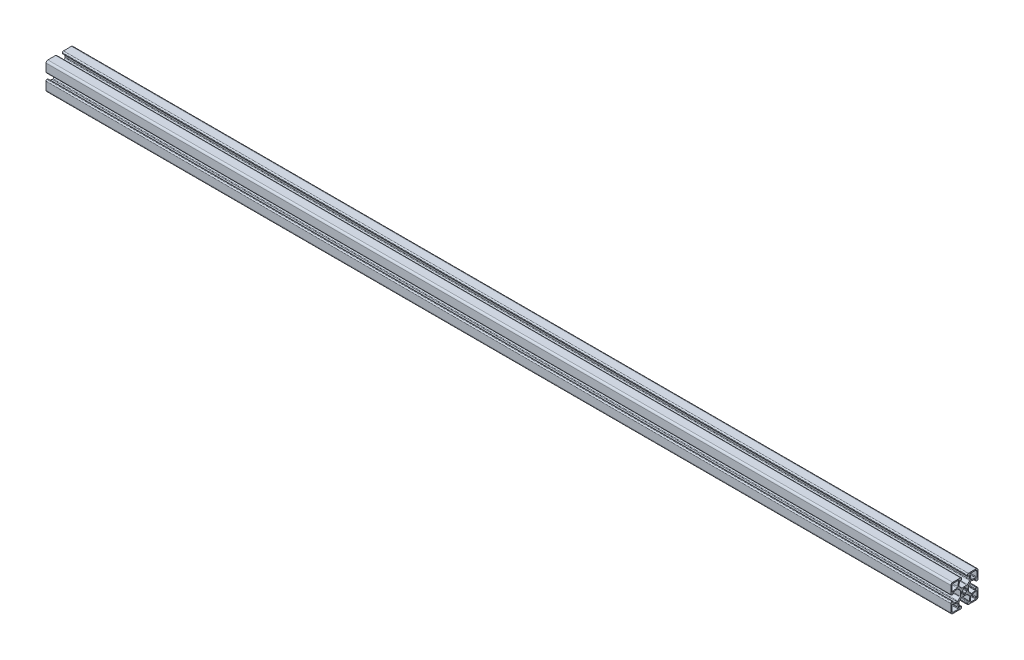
from build123d import *

# Parameters (mm, degrees)
EXTRUDE_1_DEPTH = 1000


with BuildPart() as part:
    # Sketch 1 → Extrude 1 (new body)
    with BuildSketch(Plane(origin=(0, 0, 0), x_dir=(0, 0, -1), z_dir=(1, 0, 0))):
        with BuildLine():
            Line((13.799999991, -3.150000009), (13.150000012, -3.150000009))
            ThreePointArc((13.150000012, -3.150000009), (12.619669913, -3.369669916), (12.399999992, -3.900000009))
            Line((12.399999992, -3.900000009), (12.399999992, -4.892473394))
            ThreePointArc((12.399999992, -4.892473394), (12.283022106, -5.213867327), (11.986823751, -5.384877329))
            Line((11.986823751, -5.384877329), (8.089371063, -6.072103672))
            ThreePointArc((8.089371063, -6.072103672), (7.61501703, -6.041012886), (7.208616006, -5.794402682))
            Line((7.208616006, -5.794402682), (4.792892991, -3.378679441))
            ThreePointArc((4.792892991, -3.378679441), (4.576120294, -3.054256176), (4.499999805, -2.67157285))
            Line((4.499999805, -2.67157285), (4.499999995, 2.671572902))
            ThreePointArc((4.499999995, 2.671572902), (4.576120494, 3.054256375), (4.792893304, 3.378679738))
            Line((4.792893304, 3.378679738), (7.208616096, 5.79440253))
            ThreePointArc((7.208616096, 5.79440253), (7.615017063, 6.041012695), (8.089371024, 6.072103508))
            Line((8.089371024, 6.072103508), (11.986824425, 5.384877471))
            ThreePointArc((11.986824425, 5.384877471), (12.283022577, 5.213867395), (12.400000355, 4.892473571))
            Line((12.400000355, 4.892473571), (12.400000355, 3.899999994))
            ThreePointArc((12.400000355, 3.899999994), (12.619670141, 3.369670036), (13.149999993, 3.149999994))
            Line((13.149999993, 3.149999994), (13.799999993, 3.149999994))
            ThreePointArc((13.799999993, 3.149999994), (14.648528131, 3.501471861), (14.999999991, 4.350000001))
            Line((14.999999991, 4.350000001), (14.999999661, 13.000000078))
            ThreePointArc((14.999999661, 13.000000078), (14.414213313, 14.414213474), (12.999999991, 15.000000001))
            Line((12.999999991, 15.000000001), (4.349999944, 14.999999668))
            ThreePointArc((4.349999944, 14.999999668), (3.501471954, 14.648527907), (3.14999999, 13.800000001))
            Line((3.14999999, 13.800000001), (3.14999999, 13.150000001))
            ThreePointArc((3.14999999, 13.150000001), (3.369669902, 12.619669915), (3.899999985, 12.399999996))
            Line((3.899999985, 12.399999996), (4.89247338, 12.399999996))
            ThreePointArc((4.89247338, 12.399999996), (5.213867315, 12.283022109), (5.384877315, 11.986823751))
            Line((5.384877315, 11.986823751), (6.072103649, 8.08937105))
            ThreePointArc((6.072103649, 8.08937105), (6.041012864, 7.615017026), (5.794402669, 7.208616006))
            Line((5.794402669, 7.208616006), (3.37867942, 4.792892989))
            ThreePointArc((3.37867942, 4.792892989), (3.054256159, 4.576120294), (2.671572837, 4.499999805))
            Line((2.671572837, 4.499999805), (-2.671572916, 4.499999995))
            ThreePointArc((-2.671572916, 4.499999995), (-3.054256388, 4.576120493), (-3.378679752, 4.792893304))
            Line((-3.378679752, 4.792893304), (-5.79440254, 7.208616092))
            ThreePointArc((-5.79440254, 7.208616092), (-6.041012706, 7.615017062), (-6.072103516, 8.089371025))
            Line((-6.072103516, 8.089371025), (-5.384877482, 11.986824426))
            ThreePointArc((-5.384877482, 11.986824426), (-5.213867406, 12.283022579), (-4.892473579, 12.400000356))
            Line((-4.892473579, 12.400000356), (-3.900000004, 12.400000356))
            ThreePointArc((-3.900000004, 12.400000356), (-3.369670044, 12.619670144), (-3.150000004, 13.15))
            Line((-3.150000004, 13.15), (-3.150000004, 13.8))
            ThreePointArc((-3.150000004, 13.8), (-3.501471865, 14.648528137), (-4.350000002, 15.000000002))
            Line((-4.350000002, 15.000000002), (-13.000000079, 14.999999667))
            ThreePointArc((-13.000000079, 14.999999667), (-14.414213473, 14.41421332), (-15.000000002, 13.000000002))
            Line((-15.000000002, 13.000000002), (-14.999999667, 4.349999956))
            ThreePointArc((-14.999999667, 4.349999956), (-14.648527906, 3.501471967), (-13.800000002, 3.150000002))
            Line((-13.800000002, 3.150000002), (-13.150000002, 3.150000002))
            ThreePointArc((-13.150000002, 3.150000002), (-12.619669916, 3.369669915), (-12.4, 3.9))
            Line((-12.4, 3.9), (-12.4, 4.892473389))
            ThreePointArc((-12.4, 4.892473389), (-12.283022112, 5.213867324), (-11.986823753, 5.384877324))
            Line((-11.986823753, 5.384877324), (-8.089371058, 6.072103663))
            ThreePointArc((-8.089371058, 6.072103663), (-7.615017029, 6.041012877), (-7.208616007, 5.794402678))
            Line((-7.208616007, 5.794402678), (-4.79289299, 3.378679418))
            ThreePointArc((-4.79289299, 3.378679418), (-4.576120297, 3.054256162), (-4.499999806, 2.671572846))
            Line((-4.499999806, 2.671572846), (-4.500000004, -2.671572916))
            ThreePointArc((-4.500000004, -2.671572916), (-4.576120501, -3.054256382), (-4.792893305, -3.378679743))
            Line((-4.792893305, -3.378679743), (-7.208616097, -5.794402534))
            ThreePointArc((-7.208616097, -5.794402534), (-7.615017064, -6.041012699), (-8.089371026, -6.072103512))
            Line((-8.089371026, -6.072103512), (-11.986824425, -5.384877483))
            ThreePointArc((-11.986824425, -5.384877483), (-12.28302258, -5.213867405), (-12.400000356, -4.892473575))
            Line((-12.400000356, -4.892473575), (-12.400000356, -3.900000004))
            ThreePointArc((-12.400000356, -3.900000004), (-12.619679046, -3.369661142), (-13.150025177, -3.150000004))
            Line((-13.150025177, -3.150000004), (-13.800000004, -3.150000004))
            ThreePointArc((-13.800000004, -3.150000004), (-14.648528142, -3.501471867), (-15.000000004, -4.350000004))
            Line((-15.000000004, -4.350000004), (-14.999999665, -13.000000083))
            ThreePointArc((-14.999999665, -13.000000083), (-14.414213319, -14.414213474), (-13.000000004, -15.000000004))
            Line((-13.000000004, -15.000000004), (-4.349999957, -14.999999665))
            ThreePointArc((-4.349999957, -14.999999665), (-3.50147197, -14.648527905), (-3.150000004, -13.800000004))
            Line((-3.150000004, -13.800000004), (-3.150000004, -13.150000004))
            ThreePointArc((-3.150000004, -13.150000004), (-3.369669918, -12.619669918), (-3.900000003, -12.400000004))
            Line((-3.900000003, -12.400000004), (-4.892473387, -12.400000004))
            ThreePointArc((-4.892473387, -12.400000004), (-5.213867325, -12.283022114), (-5.384877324, -11.986823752))
            Line((-5.384877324, -11.986823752), (-6.072103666, -8.089371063))
            ThreePointArc((-6.072103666, -8.089371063), (-6.04101288, -7.615017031), (-5.794402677, -7.208616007))
            Line((-5.794402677, -7.208616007), (-3.378679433, -4.792892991))
            ThreePointArc((-3.378679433, -4.792892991), (-3.05425617, -4.576120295), (-2.671572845, -4.499999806))
            Line((-2.671572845, -4.499999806), (2.671572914, -4.500000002))
            ThreePointArc((2.671572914, -4.500000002), (3.054256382, -4.576120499), (3.378679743, -4.792893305))
            Line((3.378679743, -4.792893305), (5.794402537, -7.208616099))
            ThreePointArc((5.794402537, -7.208616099), (6.041012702, -7.615017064), (6.072103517, -8.089371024))
            Line((6.072103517, -8.089371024), (5.384877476, -11.986824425))
            ThreePointArc((5.384877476, -11.986824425), (5.213867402, -12.283022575), (4.89247358, -12.400000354))
            Line((4.89247358, -12.400000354), (3.899999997, -12.400000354))
            ThreePointArc((3.899999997, -12.400000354), (3.369670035, -12.619670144), (3.149999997, -13.150000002))
            Line((3.149999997, -13.150000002), (3.149999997, -13.800000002))
            ThreePointArc((3.149999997, -13.800000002), (3.501471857, -14.64852814), (4.34999999, -15.000000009))
            Line((4.34999999, -15.000000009), (13.000000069, -14.999999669))
            ThreePointArc((13.000000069, -14.999999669), (14.414213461, -14.414213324), (14.999999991, -13.000000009))
            Line((14.999999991, -13.000000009), (14.999999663, -4.349999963))
            ThreePointArc((14.999999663, -4.349999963), (14.648527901, -3.501471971), (13.799999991, -3.150000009))
        make_face()
        with BuildLine():
            Line((-12.451471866, -13.820000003), (-6.649665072, -13.820000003))
            ThreePointArc((-6.649665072, -13.820000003), (-6.185885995, -13.535178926), (-6.230161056, -12.992727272))
            ThreePointArc((-6.230161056, -12.992727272), (-6.420017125, -12.6594169), (-6.529318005, -12.291728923))
            Line((-6.529318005, -12.291728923), (-7.269060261, -8.096442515))
            ThreePointArc((-7.269060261, -8.096442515), (-7.552315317, -7.552314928), (-8.096442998, -7.269060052))
            Line((-8.096442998, -7.269060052), (-12.29172854, -6.529318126))
            ThreePointArc((-12.29172854, -6.529318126), (-12.659416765, -6.420017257), (-12.992727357, -6.230161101))
            ThreePointArc((-12.992727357, -6.230161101), (-13.535178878, -6.185886), (-13.82, -6.649664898))
            Line((-13.82, -6.649664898), (-13.82, -12.451471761))
            ThreePointArc((-13.82, -12.451471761), (-13.655996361, -12.830505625), (-13.267436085, -12.970451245))
            ThreePointArc((-13.267436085, -12.970451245), (-13.051911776, -13.051911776), (-12.970451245, -13.267436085))
            ThreePointArc((-12.970451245, -13.267436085), (-12.830505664, -13.655996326), (-12.451471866, -13.820000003))
        make_face(mode=Mode.SUBTRACT)
        with BuildLine():
            Line((12.451471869, 13.820000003), (6.649665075, 13.820000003))
            ThreePointArc((6.649665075, 13.820000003), (6.185885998, 13.535178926), (6.230161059, 12.992727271))
            ThreePointArc((6.230161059, 12.992727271), (6.42001711, 12.659416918), (6.529317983, 12.291728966))
            Line((6.529317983, 12.291728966), (7.269060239, 8.096442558))
            ThreePointArc((7.269060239, 8.096442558), (7.552315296, 7.552314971), (8.096442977, 7.269060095))
            Line((8.096442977, 7.269060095), (12.291728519, 6.529318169))
            ThreePointArc((12.291728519, 6.529318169), (12.659416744, 6.4200173), (12.992727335, 6.230161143))
            ThreePointArc((12.992727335, 6.230161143), (13.535178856, 6.185886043), (13.819999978, 6.64966494))
            Line((13.819999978, 6.64966494), (13.819999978, 12.451471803))
            ThreePointArc((13.819999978, 12.451471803), (13.655996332, 12.83050563), (13.267436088, 12.970451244))
            ThreePointArc((13.267436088, 12.970451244), (13.051911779, 13.051911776), (12.970451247, 13.267436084))
            ThreePointArc((12.970451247, 13.267436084), (12.830505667, 13.655996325), (12.451471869, 13.820000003))
        make_face(mode=Mode.SUBTRACT)
        with BuildLine():
            Line((-13.82, 12.451471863), (-13.82, 6.649665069))
            ThreePointArc((-13.82, 6.649665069), (-13.535178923, 6.185885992), (-12.992727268, 6.230161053))
            ThreePointArc((-12.992727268, 6.230161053), (-12.659416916, 6.420017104), (-12.291728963, 6.529317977))
            Line((-12.291728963, 6.529317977), (-8.096442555, 7.269060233))
            ThreePointArc((-8.096442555, 7.269060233), (-7.552314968, 7.552315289), (-7.269060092, 8.09644297))
            Line((-7.269060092, 8.09644297), (-6.529318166, 12.291728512))
            ThreePointArc((-6.529318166, 12.291728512), (-6.420017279, 12.659416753), (-6.230161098, 12.992727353))
            ThreePointArc((-6.230161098, 12.992727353), (-6.185885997, 13.535178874), (-6.649664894, 13.819999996))
            Line((-6.649664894, 13.819999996), (-12.451471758, 13.819999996))
            ThreePointArc((-12.451471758, 13.819999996), (-12.830505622, 13.655996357), (-12.970451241, 13.267436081))
            ThreePointArc((-12.970451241, 13.267436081), (-13.051911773, 13.051911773), (-13.267436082, 12.970451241))
            ThreePointArc((-13.267436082, 12.970451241), (-13.655996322, 12.83050566), (-13.82, 12.451471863))
        make_face(mode=Mode.SUBTRACT)
        with BuildLine():
            Line((1.000000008, 2.655654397), (1.000000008, 3.000000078))
            ThreePointArc((1.000000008, 3.000000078), (0.853553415, 3.353553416), (0.500000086, 3.500000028))
            Line((0.500000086, 3.500000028), (-0.50000004, 3.500000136))
            ThreePointArc((-0.50000004, 3.500000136), (-0.853553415, 3.353553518), (-1.000000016, 3.000000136))
            Line((-1.000000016, 3.000000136), (-1.000000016, 2.655654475))
            ThreePointArc((-1.000000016, 2.655654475), (-1.068172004, 2.403613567), (-1.254098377, 2.220301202))
            ThreePointArc((-1.254098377, 2.220301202), (-1.803122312, 1.803122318), (-2.220301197, 1.254098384))
            ThreePointArc((-2.220301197, 1.254098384), (-2.403613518, 1.068172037), (-2.655654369, 1.000000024))
            Line((-2.655654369, 1.000000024), (-3.00000005, 1.000000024))
            ThreePointArc((-3.00000005, 1.000000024), (-3.353553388, 0.853553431), (-3.5, 0.500000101))
            Line((-3.5, 0.500000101), (-3.500000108, -0.500000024))
            ThreePointArc((-3.500000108, -0.500000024), (-3.35355349, -0.853553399), (-3.000000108, -1))
            Line((-3.000000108, -1), (-2.655654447, -1))
            ThreePointArc((-2.655654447, -1), (-2.403613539, -1.068171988), (-2.220301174, -1.254098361))
            ThreePointArc((-2.220301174, -1.254098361), (-1.803122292, -1.803122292), (-1.254098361, -2.220301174))
            ThreePointArc((-1.254098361, -2.220301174), (-1.068172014, -2.403613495), (-1, -2.655654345))
            Line((-1, -2.655654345), (-1, -3.000000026))
            ThreePointArc((-1, -3.000000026), (-0.853553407, -3.353553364), (-0.500000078, -3.499999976))
            Line((-0.500000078, -3.499999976), (0.500000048, -3.500000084))
            ThreePointArc((0.500000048, -3.500000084), (0.853553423, -3.353553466), (1.000000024, -3.000000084))
            Line((1.000000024, -3.000000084), (1.000000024, -2.655654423))
            ThreePointArc((1.000000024, -2.655654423), (1.068172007, -2.403613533), (1.254098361, -2.220301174))
            ThreePointArc((1.254098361, -2.220301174), (1.803122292, -1.803122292), (2.220301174, -1.254098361))
            ThreePointArc((2.220301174, -1.254098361), (2.403613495, -1.068172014), (2.655654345, -1))
            Line((2.655654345, -1), (3.000000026, -1))
            ThreePointArc((3.000000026, -1), (3.353553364, -0.853553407), (3.499999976, -0.500000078))
            Line((3.499999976, -0.500000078), (3.500000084, 0.500000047))
            ThreePointArc((3.500000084, 0.500000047), (3.353553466, 0.853553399), (3.000000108, 1))
            Line((3.000000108, 1), (2.655654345, 1))
            ThreePointArc((2.655654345, 1), (2.403613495, 1.068172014), (2.220301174, 1.254098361))
            ThreePointArc((2.220301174, 1.254098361), (1.803122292, 1.803122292), (1.254098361, 2.220301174))
            ThreePointArc((1.254098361, 2.220301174), (1.068172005, 2.403613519), (1.000000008, 2.655654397))
        make_face(mode=Mode.SUBTRACT)
        with BuildLine():
            Line((13.820000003, -12.451471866), (13.820000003, -6.649665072))
            ThreePointArc((13.820000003, -6.649665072), (13.535178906, -6.185885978), (12.992727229, -6.230161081))
            ThreePointArc((12.992727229, -6.230161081), (12.659416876, -6.420017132), (12.291728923, -6.529318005))
            Line((12.291728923, -6.529318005), (8.096442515, -7.269060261))
            ThreePointArc((8.096442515, -7.269060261), (7.552314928, -7.552315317), (7.269060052, -8.096442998))
            Line((7.269060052, -8.096442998), (6.529318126, -12.29172854))
            ThreePointArc((6.529318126, -12.29172854), (6.420017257, -12.659416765), (6.230161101, -12.992727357))
            ThreePointArc((6.230161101, -12.992727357), (6.185886, -13.535178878), (6.649664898, -13.82))
            Line((6.649664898, -13.82), (12.451471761, -13.82))
            ThreePointArc((12.451471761, -13.82), (12.830505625, -13.655996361), (12.970451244, -13.267436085))
            ThreePointArc((12.970451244, -13.267436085), (13.051911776, -13.051911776), (13.267436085, -12.970451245))
            ThreePointArc((13.267436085, -12.970451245), (13.655996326, -12.830505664), (13.820000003, -12.451471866))
        make_face(mode=Mode.SUBTRACT)
    extrude(amount=EXTRUDE_1_DEPTH)


solid = part.part
